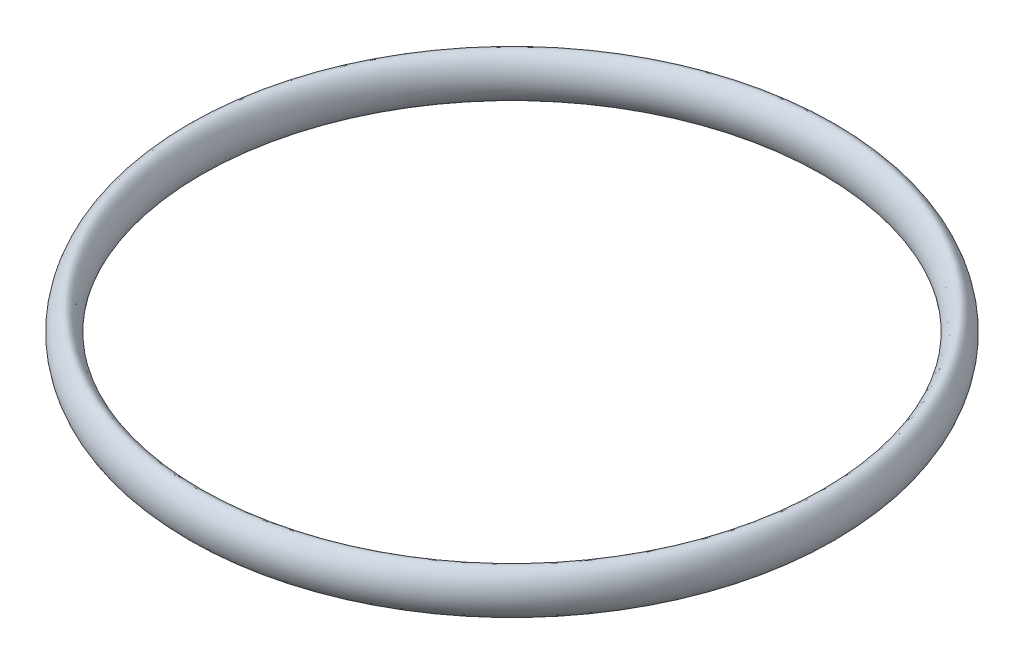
ISO-10303-21;
HEADER;
FILE_DESCRIPTION(('STEP AP214'),'2;1');
FILE_NAME('part.step','',(''),(''),'','','');
FILE_SCHEMA(('AUTOMOTIVE_DESIGN { 1 0 10303 214 1 1 1 1 }'));
ENDSEC;
DATA;
#1=APPLICATION_CONTEXT('core data for automotive mechanical design processes');
#2=APPLICATION_PROTOCOL_DEFINITION('international standard','automotive_design',2000,#1);
#3=PRODUCT_CONTEXT('',#1,'mechanical');
#4=PRODUCT('Part','Part','',(#3));
#5=PRODUCT_RELATED_PRODUCT_CATEGORY('part','',(#4));
#6=PRODUCT_DEFINITION_FORMATION('','',#4);
#7=PRODUCT_DEFINITION_CONTEXT('part definition',#1,'design');
#8=PRODUCT_DEFINITION('design','',#6,#7);
#9=PRODUCT_DEFINITION_SHAPE('','',#8);
#10=(LENGTH_UNIT() NAMED_UNIT(*) SI_UNIT(.MILLI.,.METRE.));
#11=(NAMED_UNIT(*) PLANE_ANGLE_UNIT() SI_UNIT($,.RADIAN.));
#12=(NAMED_UNIT(*) SI_UNIT($,.STERADIAN.) SOLID_ANGLE_UNIT());
#13=UNCERTAINTY_MEASURE_WITH_UNIT(LENGTH_MEASURE(1.E-05),#10,'distance_accuracy_value','');
#14=(GEOMETRIC_REPRESENTATION_CONTEXT(3) GLOBAL_UNCERTAINTY_ASSIGNED_CONTEXT((#13)) GLOBAL_UNIT_ASSIGNED_CONTEXT((#10,
#11,#12)) REPRESENTATION_CONTEXT('',''));
#15=CARTESIAN_POINT('',(0.,0.,0.));
#16=DIRECTION('',(0.,0.,1.));
#17=DIRECTION('',(1.,0.,0.));
#18=AXIS2_PLACEMENT_3D('',#15,#16,#17);
#19=CARTESIAN_POINT('',(-34.43,2.385,0.));
#20=CARTESIAN_POINT('',(-35.145,2.385,0.));
#21=CARTESIAN_POINT('',(-36.575,0.,0.));
#22=CARTESIAN_POINT('',(-34.43,-3.5775,0.));
#23=CARTESIAN_POINT('',(-32.285,0.,0.));
#24=CARTESIAN_POINT('',(-33.715,2.385,0.));
#25=CARTESIAN_POINT('',(-34.43,2.385,0.));
#26=B_SPLINE_CURVE_WITH_KNOTS('',3,(#19,#20,#21,#22,#23,#24,#25),.UNSPECIFIED.,.T.,.F.,(4,1,1,1,
4),(0.,0.25,0.5,0.75,1.),.UNSPECIFIED.);
#27=CARTESIAN_POINT('',(0.,0.,0.));
#28=DIRECTION('',(0.,-1.,0.));
#29=AXIS1_PLACEMENT('',#27,#28);
#30=SURFACE_OF_REVOLUTION('',#26,#29);
#31=ADVANCED_FACE('F28',(),#30,.T.);
#32=CLOSED_SHELL('',(#31));
#33=MANIFOLD_SOLID_BREP('B2',#32);
#34=ADVANCED_BREP_SHAPE_REPRESENTATION('',(#18,#33),#14);
#35=SHAPE_DEFINITION_REPRESENTATION(#9,#34);
ENDSEC;
END-ISO-10303-21;
